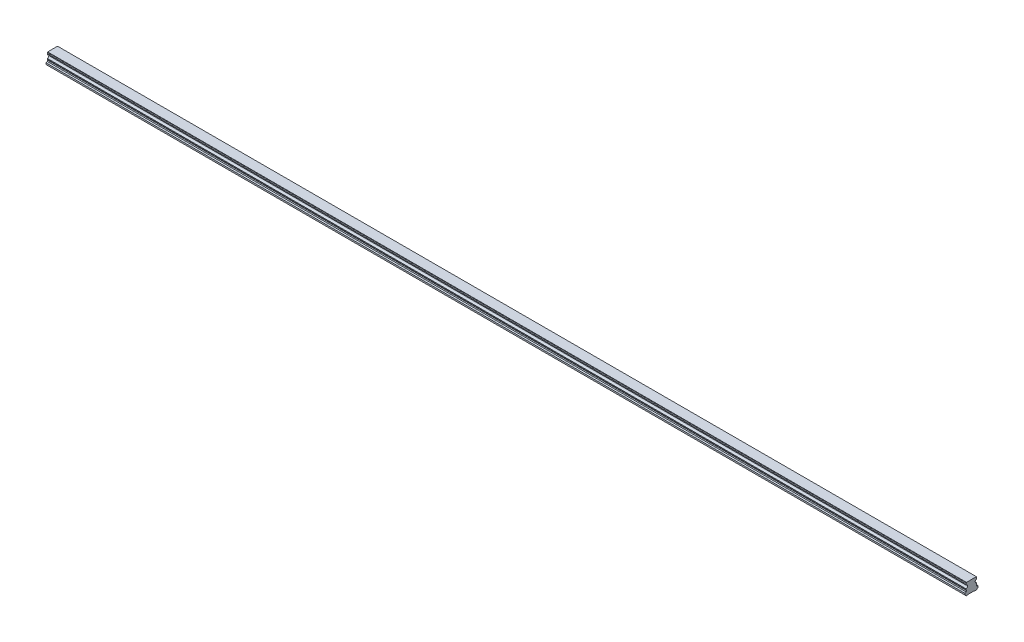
from build123d import *

# Parameters (mm, degrees)
BOSS_EXTRUDE1_DEPTH        = 1740
SKETCH3_R                  = 3
SKETCH3_R_2                = 2.5
CUT_EXTRUDE3_DEPTH         = 12
SKETCH3_2_R                = 2.5
CUT_EXTRUDE4_DEPTH         = 15
CHAMFER1_SIZE              = 0.5
LPATTERN4_COUNT            = 29
LPATTERN4_PITCH            = 60
CHAMFER1_OF_LPATTERN4_SIZE = 0.5


with BuildPart() as part:
    # Sketch1 → Boss-Extrude1 (new body)
    with BuildSketch(Plane(origin=(0, 0, 0), x_dir=(0, 0, -1), z_dir=(1, 0, 0))):
        with BuildLine():
            Line((9.375, 21.8), (-9.375, 21.8))
            Line((-9.375, 21.8), (-9.375, 20.756))
            Line((-9.375, 20.756), (-10, 19.415683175))
            Line((-10, 19.415683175), (-10, 17.685449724))
            ThreePointArc((-10, 17.685449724), (-7.2, 14.6), (-10, 11.514550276))
            Line((-10, 11.514550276), (-10, 9.784316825))
            Line((-10, 9.784316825), (-9.375, 8.444))
            Line((-9.375, 8.444), (-9.922688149, 6.4))
            Line((-9.922688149, 6.4), (-12.5, 5.489338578))
            Line((-12.5, 5.489338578), (-12.5, 2.65))
            Line((-12.5, 2.65), (-9.85, 0))
            Line((-9.85, 0), (-5.5, 0))
            Line((-5.5, 0), (-5, 0.5))
            Line((-5, 0.5), (5, 0.5))
            Line((5, 0.5), (5.5, 0))
            Line((5.5, 0), (9.85, 0))
            Line((9.85, 0), (12.5, 2.65))
            Line((12.5, 2.65), (12.5, 5.489338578))
            Line((12.5, 5.489338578), (9.922688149, 6.4))
            Line((9.922688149, 6.4), (9.375, 8.444))
            Line((9.375, 8.444), (10, 9.784316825))
            Line((10, 9.784316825), (10, 11.514550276))
            ThreePointArc((10, 11.514550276), (7.2, 14.6), (10, 17.685449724))
            Line((10, 17.685449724), (10, 19.415683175))
            Line((10, 19.415683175), (9.375, 20.756))
            Line((9.375, 20.756), (9.375, 21.8))
        make_face()
    extrude(amount=BOSS_EXTRUDE1_DEPTH)

    # Sketch3 → Cut-Extrude3 (cut)
    with BuildSketch(Plane.XZ):
        with Locations(Location((30, 0, 0), (0, 0, 270))):
            Circle(SKETCH3_R)
        with Locations(Location((30, 0, 0), (0, 0, 270))):
            Circle(SKETCH3_R_2, mode=Mode.SUBTRACT)
    cut_extrude3 = extrude(amount=-CUT_EXTRUDE3_DEPTH, mode=Mode.SUBTRACT)

    # Sketch3_2 → Cut-Extrude4 (cut)
    with BuildSketch(Plane.XZ):
        with Locations(Location((30, 0, 0), (0, 0, 270))):
            Circle(SKETCH3_2_R)
    cut_extrude4 = extrude(amount=-CUT_EXTRUDE4_DEPTH, mode=Mode.SUBTRACT)

    # Cut-Extrude5 cone 1 section (on through the dimple's axis) → Cut-Extrude5 (revolve, cut)
    with BuildSketch(Plane(origin=(30, 15, 0), x_dir=(0, 0, -1), z_dir=(1, 0, 0))):
        Polygon((0, 0), (2.5, 0), (0, 1.443375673), align=None)
    cut_extrude5 = revolve(axis=Axis((30, 15, 0), (0, 1, 0)), mode=Mode.SUBTRACT)

    # Chamfer1
    chamfer1_edges = [part.edges().sort_by_distance(p)[0] for p in [
        (30, 0.5, 3),
    ]]
    chamfer(chamfer1_edges, length=CHAMFER1_SIZE)

    # LPattern4: Cut-Extrude3, Cut-Extrude4, Cut-Extrude5 ×29
    with Locations(*[(i * LPATTERN4_PITCH, 0, 0) for i in range(1, LPATTERN4_COUNT)]):
        add(cut_extrude3, mode=Mode.SUBTRACT)
        add(cut_extrude4, mode=Mode.SUBTRACT)
        add(cut_extrude5, mode=Mode.SUBTRACT)

    # Chamfer1 of LPattern4
    chamfer1_of_lpattern4_edges = [part.edges().sort_by_distance(p)[0] for p in [
        (90, 0.5, 3),
        (150, 0.5, 3),
        (210, 0.5, 3),
        (270, 0.5, 3),
        (330, 0.5, 3),
        (390, 0.5, 3),
        (450, 0.5, 3),
        (510, 0.5, 3),
        (570, 0.5, 3),
        (630, 0.5, 3),
        (690, 0.5, 3),
        (750, 0.5, 3),
        (810, 0.5, 3),
        (870, 0.5, 3),
        (930, 0.5, 3),
        (990, 0.5, 3),
        (1050, 0.5, 3),
        (1110, 0.5, 3),
        (1170, 0.5, 3),
        (1230, 0.5, 3),
        (1290, 0.5, 3),
        (1350, 0.5, 3),
        (1410, 0.5, 3),
        (1470, 0.5, 3),
        (1530, 0.5, 3),
        (1590, 0.5, 3),
        (1650, 0.5, 3),
        (1710, 0.5, 3),
    ]]
    chamfer(chamfer1_of_lpattern4_edges, length=CHAMFER1_OF_LPATTERN4_SIZE)


solid = part.part
